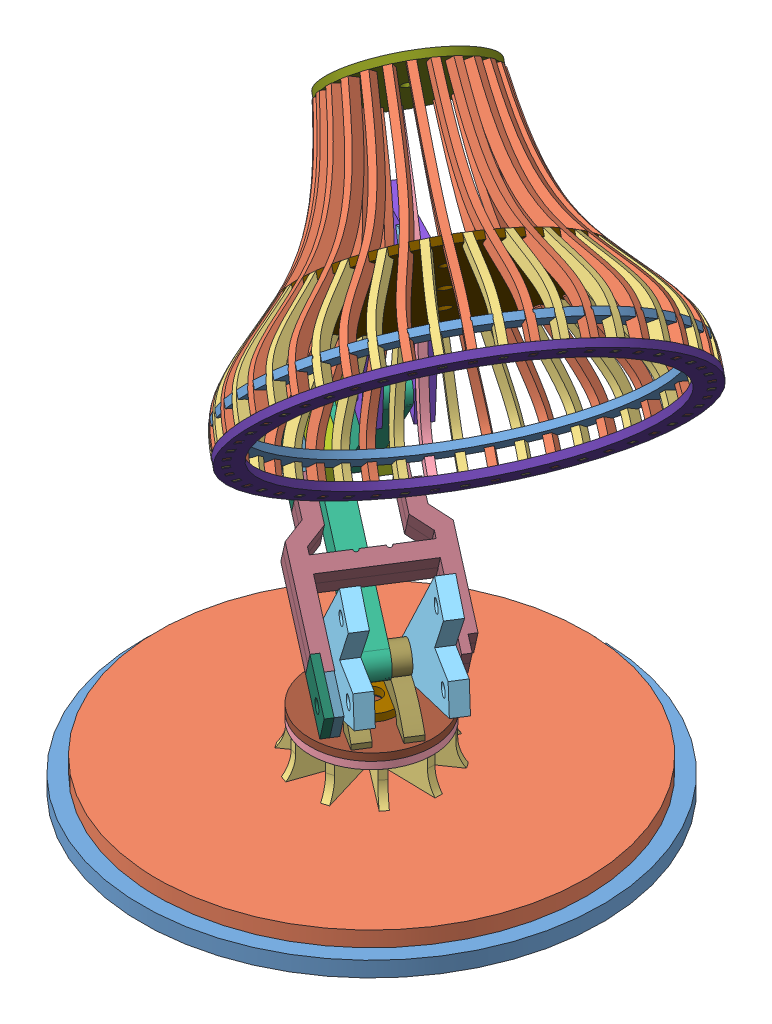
SolidWorks assembly Luxo Lamp.SLDASM, configuration Default (file format 6000). Lengths in mm.
Overall size (276.59 337.52 242.21).
89 component instances, 23 part files, 85 mates.
Components (placement in the parent):
- Base1-1: Base1.SLDPRT [Default] at (100.7787 68.4095 151.632) size (190.5 6.35 190.48)
- Base2-1: Base2.SLDPRT [Default] at (100.7787 74.7595 151.632) x (0.999762 0 0.021818) z (-0.021818 0 0.999762) size (177.8 6.35 177.8)
- Base Struts-1: Base Struts.SLDPRT [Default] at (87.312 79.649 143.1148) x (0.605296 0 -0.796) z (0.796 0 0.605296) size (3 18.54 22.23)
- Base Struts-2: Base Struts.SLDPRT [Default] at (84.8776 79.649 152.657) x (0.021818 0 -0.999762) z (0.999762 0 0.021818) size (3 18.54 22.23)
- Base Struts-3: Base Struts.SLDPRT [Default] at (88.5168 79.649 161.8077) x (-0.569995 0 -0.821648) z (0.821648 0 -0.569995) size (3 18.54 22.23)
- Base Struts-4: Base Struts.SLDPRT [Default] at (96.8397 79.649 167.0717) x (-0.944088 0 -0.329693) z (0.329693 0 -0.944088) size (3 18.54 22.23)
- Base Struts-5: Base Struts.SLDPRT [Default] at (106.6672 79.649 166.4382) x (-0.957572 0 0.288194) z (-0.288194 0 -0.957572) size (3 18.54 22.23)
- Base Struts-6: Base Struts.SLDPRT [Default] at (114.2454 79.649 160.1493) x (-0.605296 0 0.796) z (-0.796 0 -0.605296) size (3 18.54 22.23)
- Base Struts-7: Base Struts.SLDPRT [Default] at (116.6799 79.649 150.6071) x (-0.021818 0 0.999762) z (-0.999762 0 -0.021818) size (3 18.54 22.23)
- Base Struts-8: Base Struts.SLDPRT [Default] at (113.0406 79.649 141.4564) x (0.569995 0 0.821648) z (-0.821648 0 0.569995) size (3 18.54 22.23)
- Base Struts-9: Base Struts.SLDPRT [Default] at (104.7177 79.649 136.1924) x (0.944088 0 0.329693) z (-0.329693 0 0.944088) size (3 18.54 22.23)
- Base Struts-10: Base Struts.SLDPRT [Default] at (94.8902 79.649 136.8259) x (0.957572 0 -0.288194) z (0.288194 0 0.957572) size (3 18.54 22.23)
- Base Top-1: Base Top.SLDPRT [Default] at (100.7787 96.8067 151.632) x (-0.796 0 -0.605296) z (-0.605296 0 0.796) size (50.8 3 50.8)
- Bracket 1-1: Bracket 1.SLDPRT [Default] at (106.7366 115.0439 142.2517) x (-0.732725 0.49652 -0.465383) z (0.53614 0 -0.844129) size (48.36 73.37 6.35)
- Bracket 1-2: Bracket 1.SLDPRT [Default] at (91.4164 115.0439 166.3727) x (-0.732725 0.49652 -0.465383) z (0.53614 0 -0.844129) size (48.36 73.37 6.35)
- Strut-1: Strut.SLDPRT [Default] at (67.8361 133.9001 136.3508) x (-0.39166 -0.885845 -0.248759) z (0.53614 0 -0.844129) size (12.7 93.98 9.53)
- Bracket 2-1: Bracket 2.SLDPRT [Default] at (42.5535 152.7563 109.009) x (-0.489425 0.814759 -0.310853) z (0.53614 0 -0.844129) size (60.9 65.32 6.35)
- Bracket 2-2: Bracket 2.SLDPRT [Default] at (34.0423 152.7563 122.4096) x (-0.489425 0.814759 -0.310853) z (0.53614 0 -0.844129) size (60.9 65.32 6.35)
- Bracket 3-1: Bracket 3.SLDPRT [Default] at (124.9103 260.4199 161.3171) x (-0.316592 0.927004 -0.20108) z (0.53614 0 -0.844129) size (67.57 55.73 6.35)
- Bracket 3-2: Bracket 3.SLDPRT [Default] at (116.3991 260.4199 174.7176) x (-0.316592 0.927004 -0.20108) z (0.53614 0 -0.844129) size (67.57 55.73 6.35)
- Strut-2: Strut.SLDPRT [Default] at (99.7866 202.9762 156.6438) x (-0.628277 0.667857 -0.399043) z (0.53614 0 -0.844129) size (12.7 93.98 9.53)
- Strut-3: Strut.SLDPRT [Default] at (73.6972 239.206 140.0734) x (-0.670979 0.606771 -0.426165) z (0.53614 0 -0.844129) size (12.7 93.98 9.53)
- Swivel Bearing Clip-1: Swivel Bearing Clip.SLDPRT [Default] at (100.7787 90.8123 151.632) x (0.997429 0 0.071662) z (-0.071662 0 0.997429) size (20.32 3 20.32)
- Swivel Bearing Spacer-1: Swivel Bearing Spacer.SLDPRT [Default] at (100.7787 100.1595 151.632) x (0.975702 0 -0.2191) z (0 -1 0) size (15.24 15.24 6.35)
- Swivel Plate-1: Swivel Plate.SLDPRT [Default] at (100.7787 96.8067 151.632) x (0.53614 0 -0.844129) z (0.844129 0 0.53614) size (50.8 3 50.8)
- Swivel Bearing Clip-2: Swivel Bearing Clip.SLDPRT [Default] at (100.7787 100.1595 151.632) size (20.32 3 20.32)
- Swivel to Pivot-1: Swivel to Pivot.SLDPRT [Default] at (94.8209 99.8039 161.0124) x (-0.844129 0 -0.53614) z (0.53614 0 -0.844129) size (44.2 23.75 6.35)
- Swivel to Pivot-2: Swivel to Pivot.SLDPRT [Default] at (103.3321 99.8039 147.6119) x (-0.844129 0 -0.53614) z (0.53614 0 -0.844129) size (44.2 23.75 6.35)
- Special Strut-1: Special Strut.SLDPRT [Default] at (136.8693 129.3907 176.4352) x (0.53614 0 -0.844129) z (0.747768 -0.463981 0.474937) size (50.5 6.35 66.04)
- Special Strut-2: Special Strut.SLDPRT [Default] at (141.8433 140.641 179.5944) x (-0.53614 0 0.844129) z (0.747768 -0.463981 0.474937) size (50.5 6.35 66.04)
- Short Hole Plate-1: Short Hole Plate.SLDPRT [Default] at (130.6379 125.8552 198.8364) x (-0.747768 0.463981 -0.474937) z (0.53614 0 -0.844129) size (15.24 12.7 3)
- Long Hole Plate-1: Long Hole Plate.SLDPRT [Default] at (129.031 125.8552 201.3665) x (-0.747768 0.463981 -0.474937) z (0.53614 0 -0.844129) size (21.59 12.7 3)
- Long Hole Plate-2: Long Hole Plate.SLDPRT [Default] at (65.235 181.8889 153.3246) x (0.747768 -0.463981 0.474937) z (0.53614 0 -0.844129) size (21.59 12.7 3)
- Short Hole Plate-2: Short Hole Plate.SLDPRT [Default] at (73.2638 163.5676 154.8734) x (-0.747768 0.463981 -0.474937) z (0.53614 0 -0.844129) size (15.24 12.7 3)
- Lamp Shade Top Disk-1: Lamp Shade Top Disk.SLDPRT [Default] at (132.7701 345.9993 167.9269) x (0.653427 0.191305 -0.732417) z (0.389074 0.745086 0.541727) size (57.15 3 57.15)
- Lamp Shade Bottom Disk-1: Lamp Shade Bottom Disk.SLDPRT [Default] at (200.3469 279.2599 210.7639) x (0.571952 0.767735 0.288884) z (-0.501215 0.048302 0.863973) size (152.4 3 152.4)
- Lamp Shade Mid Disk-1: Lamp Shade Mid Disk.SLDPRT [Default] at (171.3931 307.9811 192.4538) x (0.599511 0.096413 -0.794539) z (0.649349 -0.638944 0.412427) size (102.19 102.16 2.95)
- Lamp Shade Bottom Disk 2-1: Lamp Shade Bottom Disk 2.SLDPRT [Default] at (193.9308 285.8302 206.7796) x (0.742668 0.649502 -0.163071) z (-0.649349 0.638944 -0.412427) size (150.54 150.51 2.95)
- Lamp Shade 1-27: Lamp Shade 1.SLDPRT [Default] at (199.7013 278.4095 209.8471) x (0.676568 0.237712 -0.696957) z (0.347278 0.731603 0.586647) size (52.7 106.68 3)
- Lamp Shade 1-28: Lamp Shade 1.SLDPRT [Default] at (199.4834 278.3594 210.1125) x (0.568948 0.048302 -0.820954) z (0.504623 0.767735 0.394891) size (52.7 106.68 3)
- Lamp Shade 1-29: Lamp Shade 1.SLDPRT [Default] at (199.3095 278.3762 210.4123) x (0.425579 -0.144144 -0.893367) z (0.630261 0.755627 0.178322) size (52.7 106.68 3)
- Lamp Shade 1-30: Lamp Shade 1.SLDPRT [Default] at (199.1904 278.4587 210.7276) x (0.255469 -0.327532 -0.909647) z (0.716297 0.696041 -0.049452) size (52.7 106.68 3)
- Lamp Shade 1-31: Lamp Shade 1.SLDPRT [Default] at (199.1336 278.6017 211.0386) x (0.069307 -0.49034 -0.868771) z (0.757326 0.59272 -0.274119) size (52.7 106.68 3)
- Lamp Shade 1-32: Lamp Shade 1.SLDPRT [Default] at (199.1427 278.7963 211.3258) x (-0.12121 -0.622339 -0.773306) z (0.750769 0.452156 -0.481561) size (52.7 106.68 3)
- Lamp Shade 1-33: Lamp Shade 1.SLDPRT [Default] at (199.2171 279.0302 211.5711) x (-0.30411 -0.715233 -0.629252) z (0.697039 0.283181 -0.658746) size (52.7 106.68 3)
- Lamp Shade 1-34: Lamp Shade 1.SLDPRT [Default] at (199.3521 279.2888 211.759) x (-0.467903 -0.763187 -0.44566) z (0.599511 0.096413 -0.794539) size (52.7 106.68 3)
- Lamp Shade 1-35: Lamp Shade 1.SLDPRT [Default] at (199.5392 279.5557 211.8779) x (-0.602295 -0.763187 -0.234065) z (0.464313 -0.096413 -0.880408) size (52.7 106.68 3)
- Lamp Shade 1-36: Lamp Shade 1.SLDPRT [Default] at (199.7668 279.8142 211.9202) x (-0.698843 -0.715233 -0.007763) z (0.299941 -0.283181 -0.910958) size (52.7 106.68 3)
- Lamp Shade 1-37: Lamp Shade 1.SLDPRT [Default] at (200.0204 280.0481 211.8833) x (-0.75148 -0.622339 0.219027) z (0.116723 -0.452156 -0.884269) size (52.7 106.68 3)
- Lamp Shade 1-38: Lamp Shade 1.SLDPRT [Default] at (200.2842 280.2427 211.7694) x (-0.756898 -0.49034 0.432055) z (-0.073829 -0.59272 -0.802018) size (52.7 106.68 3)
- Lamp Shade 1-39: Lamp Shade 1.SLDPRT [Default] at (200.5416 280.3857 211.5858) x (-0.714758 -0.327532 0.617935) z (-0.259743 -0.696041 -0.669373) size (52.7 106.68 3)
- Lamp Shade 1-40: Lamp Shade 1.SLDPRT [Default] at (200.7763 280.4682 211.3439) x (-0.627707 -0.144144 0.764988) z (-0.429336 -0.755627 -0.49467) size (52.7 106.68 3)
- Lamp Shade 1-41: Lamp Shade 1.SLDPRT [Default] at (200.9737 280.485 211.0591) x (-0.501215 0.048302 0.863973) z (-0.571952 -0.767735 -0.288884) size (52.7 106.68 3)
- Lamp Shade 1-42: Lamp Shade 1.SLDPRT [Default] at (201.1214 280.435 210.7491) x (-0.34323 0.237712 0.908673) z (-0.67863 -0.731603 -0.064947) size (52.7 106.68 3)
- Lamp Shade 1-43: Lamp Shade 1.SLDPRT [Default] at (201.2101 280.3213 210.4334) x (-0.163679 0.412186 0.896277) z (-0.742668 -0.649502 0.163071) size (52.7 106.68 3)
- Lamp Shade 1-44: Lamp Shade 1.SLDPRT [Default] at (201.2341 280.1512 210.132) x (0.026158 0.560761 0.827564) z (-0.760041 -0.52659 0.380843) size (52.7 106.68 3)
- Lamp Shade 1-45: Lamp Shade 1.SLDPRT [Default] at (201.1921 279.9352 209.8636) x (0.21435 0.674102 0.706853) z (-0.729657 -0.37059 0.574685) size (52.7 106.68 3)
- Lamp Shade 1-46: Lamp Shade 1.SLDPRT [Default] at (201.0865 279.687 209.6453) x (0.389074 0.745086 0.541727) z (-0.653427 -0.191305 0.732417) size (52.7 106.68 3)
- Lamp Shade 1-47: Lamp Shade 1.SLDPRT [Default] at (200.7152 279.1574 209.4094) x (0.655739 0.745086 0.121875) z (-0.385164 0.191305 0.902802) size (52.7 106.68 3)
- Lamp Shade 1-48: Lamp Shade 1.SLDPRT [Default] at (200.4727 278.9092 209.4067) x (0.730925 0.674102 -0.106472) z (-0.209988 0.37059 0.904747) size (52.7 106.68 3)
- Lamp Shade 1-49: Lamp Shade 1.SLDPRT [Default] at (200.2119 278.6933 209.4827) x (0.760183 0.560761 -0.328128) z (-0.021617 0.52659 0.849845) size (52.7 106.68 3)
- Lamp Shade 1-50: Lamp Shade 1.SLDPRT [Default] at (199.9493 278.5231 209.6327) x (0.741677 0.412186 -0.529167) z (0.168112 0.649502 0.741543) size (52.7 106.68 3)
- Lamp Shade 2-27: Lamp Shade 2.SLDPRT [Default] at (201.3062 279.879 209.5967) x (0.30411 0.715233 0.629252) z (-0.697039 -0.283181 0.658746) size (29.44 44.45 3)
- Lamp Shade 2-28: Lamp Shade 2.SLDPRT [Default] at (201.1489 279.5777 209.3777) x (0.467903 0.763187 0.44566) z (-0.599511 -0.096413 0.794539) size (29.44 44.45 3)
- Lamp Shade 2-29: Lamp Shade 2.SLDPRT [Default] at (200.9309 279.2667 209.2392) x (0.602295 0.763187 0.234065) z (-0.464313 0.096413 0.880408) size (29.44 44.45 3)
- Lamp Shade 2-30: Lamp Shade 2.SLDPRT [Default] at (200.6658 278.9655 209.1899) x (0.698843 0.715233 0.007763) z (-0.299941 0.283181 0.910958) size (29.44 44.45 3)
- Lamp Shade 2-31: Lamp Shade 2.SLDPRT [Default] at (200.3703 278.6929 209.2329) x (0.75148 0.622339 -0.219027) z (-0.116723 0.452156 0.884269) size (29.44 44.45 3)
- Lamp Shade 2-32: Lamp Shade 2.SLDPRT [Default] at (200.0629 278.4662 209.3656) x (0.756898 0.49034 -0.432055) z (0.073829 0.59272 0.802018) size (29.44 44.45 3)
- Lamp Shade 2-33: Lamp Shade 2.SLDPRT [Default] at (199.7631 278.2996 209.5795) x (0.714758 0.327532 -0.617935) z (0.259743 0.696041 0.669373) size (29.44 44.45 3)
- Lamp Shade 2-34: Lamp Shade 2.SLDPRT [Default] at (199.4895 278.2035 209.8613) x (0.627707 0.144144 -0.764988) z (0.429336 0.755627 0.49467) size (29.44 44.45 3)
- Lamp Shade 2-35: Lamp Shade 2.SLDPRT [Default] at (199.2595 278.1839 210.1932) x (0.501215 -0.048302 -0.863973) z (0.571952 0.767735 0.288884) size (29.44 44.45 3)
- Lamp Shade 2-36: Lamp Shade 2.SLDPRT [Default] at (199.0874 278.2422 210.5544) x (0.34323 -0.237712 -0.908673) z (0.67863 0.731603 0.064947) size (29.44 44.45 3)
- Lamp Shade 2-37: Lamp Shade 2.SLDPRT [Default] at (198.9841 278.3746 210.9222) x (0.163679 -0.412186 -0.896277) z (0.742668 0.649502 -0.163071) size (29.44 44.45 3)
- Lamp Shade 2-38: Lamp Shade 2.SLDPRT [Default] at (198.9561 278.5729 211.2734) x (-0.026158 -0.560761 -0.827564) z (0.760041 0.52659 -0.380843) size (29.44 44.45 3)
- Lamp Shade 2-39: Lamp Shade 2.SLDPRT [Default] at (199.0051 278.8245 211.5861) x (-0.21435 -0.674102 -0.706853) z (0.729657 0.37059 -0.574685) size (29.44 44.45 3)
- Lamp Shade 2-40: Lamp Shade 2.SLDPRT [Default] at (199.1281 279.1137 211.8405) x (-0.389074 -0.745086 -0.541727) z (0.653427 0.191305 -0.732417) size (29.44 44.45 3)
- Lamp Shade 2-41: Lamp Shade 2.SLDPRT [Default] at (199.3173 279.4222 212.0207) x (-0.539352 -0.769253 -0.342563) z (0.53614 0 -0.844129) size (29.44 44.45 3)
- Lamp Shade 2-42: Lamp Shade 2.SLDPRT [Default] at (199.5608 279.7308 212.1153) x (-0.655739 -0.745086 -0.121875) z (0.385164 -0.191305 -0.902802) size (29.44 44.45 3)
- Lamp Shade 2-43: Lamp Shade 2.SLDPRT [Default] at (199.8433 280.0199 212.1184) x (-0.730925 -0.674102 0.106472) z (0.209988 -0.37059 -0.904747) size (29.44 44.45 3)
- Lamp Shade 2-44: Lamp Shade 2.SLDPRT [Default] at (200.1471 280.2716 212.0299) x (-0.760183 -0.560761 0.328128) z (0.021617 -0.52659 -0.849845) size (29.44 44.45 3)
- Lamp Shade 2-45: Lamp Shade 2.SLDPRT [Default] at (200.4531 280.4698 211.8552) x (-0.741677 -0.412186 0.529167) z (-0.168112 -0.649502 -0.741543) size (29.44 44.45 3)
- Lamp Shade 2-46: Lamp Shade 2.SLDPRT [Default] at (200.7421 280.6022 211.6054) x (-0.676568 -0.237712 0.696957) z (-0.347278 -0.731603 -0.586647) size (29.44 44.45 3)
- Lamp Shade 2-47: Lamp Shade 2.SLDPRT [Default] at (200.9959 280.6605 211.2961) x (-0.568948 -0.048302 0.820954) z (-0.504623 -0.767735 -0.394891) size (29.44 44.45 3)
- Lamp Shade 2-48: Lamp Shade 2.SLDPRT [Default] at (201.1985 280.641 210.9468) x (-0.425579 0.144144 0.893367) z (-0.630261 -0.755627 -0.178322) size (29.44 44.45 3)
- Lamp Shade 2-49: Lamp Shade 2.SLDPRT [Default] at (201.3373 280.5449 210.5794) x (-0.255469 0.327532 0.909647) z (-0.716297 -0.696041 0.049452) size (29.44 44.45 3)
- Lamp Shade 2-50: Lamp Shade 2.SLDPRT [Default] at (201.4035 280.3782 210.217) x (-0.069307 0.49034 0.868771) z (-0.757326 -0.59272 0.274119) size (29.44 44.45 3)
- Lamp Shade 2-51: Lamp Shade 2.SLDPRT [Default] at (201.3929 280.1515 209.8825) x (0.12121 0.622339 0.773306) z (-0.750769 -0.452156 0.481561) size (29.44 44.45 3)
- Lamp Shade 3-1: Lamp Shade 3.SLDPRT [Default] at (201.0009 279.5999 209.6452) x (0.539352 0.769253 0.342563) z (-0.53614 0 0.844129) size (52.7 106.68 3)
- Lamp Shade 4-1: Lamp Shade 4.SLDPRT [Default] at (199.3939 279.5999 212.1752) x (0.539352 0.769253 0.342563) z (-0.53614 0 0.844129) size (28.64 27.05 3)
Mates (geometry in assembly coordinates):
- Concentric1: concentric aligned: circle of Base1-1; circle of Base2-1
- Coincident2: coincident anti-aligned: plane of Base1-1 through (100.7787 74.7595 151.632) normal (0 1 0); plane of Base2-1 through (100.7787 74.7595 151.632) normal (0 -1 0)
- Coincident6: coincident anti-aligned: plane of Base2-1 through (85.9397 74.7595 138.625) normal (0.796 0 0.605296); plane of Base Struts-1 through (86.0934 79.649 138.4228) normal (-0.796 0 -0.605296)
- Coincident7: coincident anti-aligned: plane of Base2-1 through (90.3447 74.7595 145.4209) normal (0.605296 0 -0.796); plane of Base Struts-1 through (87.312 79.649 143.1148) normal (-0.605296 0 0.796)
- Coincident8: coincident anti-aligned: plane of Base2-1 through (100.7787 81.1095 151.632) normal (0 1 0); plane of Base Struts-1 through (89.1262 81.1095 140.729) normal (0 -1 0)
- Coincident9: coincident anti-aligned: plane of Base Struts-6 through (112.4313 93.8095 162.5351) normal (0 1 0); plane of Base Top-1 through (100.7787 93.8095 151.632) normal (0 -1 0)
- Concentric2: concentric anti-aligned: circle of Base2-1; circle of Base Top-1
- Coincident10: coincident anti-aligned: plane of Base Struts-6 through (114.2454 79.649 160.1493) normal (0.605296 0 -0.796); plane of Base Top-1 through (111.2127 93.8095 157.8432) normal (-0.605296 0 0.796)
- Concentric3: concentric anti-aligned: cylinder of Bracket 1-2 through (94.8209 115.0439 161.0124) axis (-0.53614 0 0.844129) radius 2.54; circle of Strut-1
- Concentric4: concentric aligned: circle of Bracket 1-1; circle of Strut-1
- Coincident16: coincident aligned: plane of Bracket 1-1 through (101.6346 114.2203 131.4886) normal (-0.646098 0.643553 -0.410362); plane of Bracket 1-2 through (86.3144 114.2203 155.6096) normal (-0.646098 0.643553 -0.410362)
- Concentric5: concentric aligned: circle of Strut-1; circle of Bracket 2-1
- Coincident18: coincident anti-aligned: plane of Strut-1 through (42.5535 152.7563 109.009) normal (0.53614 0 -0.844129); plane of Bracket 2-1 through (42.5535 152.7563 109.009) normal (-0.53614 0 0.844129)
- Concentric6: concentric aligned: circle of Strut-1; circle of Bracket 2-2
- Coincident20: coincident anti-aligned: plane of Strut-1 through (37.4468 152.7563 117.0494) normal (-0.53614 0 0.844129); plane of Bracket 2-2 through (37.4468 152.7563 117.0494) normal (0.53614 0 -0.844129)
- Coincident21: coincident aligned: plane of Bracket 2-1 through (65.0117 182.4 115.7506) normal (0.105893 0.9921 0.067257); plane of Bracket 2-2 through (56.5005 182.4 129.1511) normal (0.105893 0.9921 0.067257)
- Concentric7: concentric aligned: circle of Bracket 2-1; circle of Strut-3
- Coincident23: coincident anti-aligned: plane of Bracket 2-1 through (42.5535 152.7563 109.009) normal (-0.53614 0 0.844129); plane of Strut-3 through (99.6195 271.5098 145.2539) normal (0.53614 0 -0.844129)
- Concentric8: concentric aligned: circle of Bracket 2-1; circle of Strut-2
- Coincident25: coincident anti-aligned: plane of Bracket 2-1 through (42.5535 152.7563 109.009) normal (-0.53614 0 0.844129); plane of Strut-2 through (127.8044 233.2241 163.1552) normal (0.53614 0 -0.844129)
- Concentric9: concentric aligned: circle of Bracket 3-2; circle of Strut-2
- Coincident27: coincident anti-aligned: plane of Bracket 3-2 through (119.8036 260.4199 169.3574) normal (0.53614 0 -0.844129); plane of Strut-2 through (122.6977 233.2241 171.1956) normal (-0.53614 0 0.844129)
- Concentric10: concentric aligned: circle of Bracket 3-2; circle of Strut-3
- Concentric11: concentric aligned: circle of Bracket 3-1; circle of Strut-3
- Coincident30: coincident anti-aligned: plane of Bracket 3-1 through (124.9103 260.4199 161.3171) normal (-0.53614 0 0.844129); plane of Strut-3 through (99.6195 271.5098 145.2539) normal (0.53614 0 -0.844129)
- Concentric12: concentric aligned: circle of Bracket 3-1; circle of Strut-2
- Concentric13: concentric anti-aligned: circle of Base Top-1; circle of Swivel Bearing Clip-1
- Coincident32: coincident anti-aligned: plane of Base Top-1 through (100.7787 93.8095 151.632) normal (0 -1 0); plane of Swivel Bearing Clip-1 through (100.7787 93.8095 151.632) normal (0 1 0)
- Coincident34: coincident anti-aligned: plane of Swivel Bearing Clip-1 through (100.7787 93.8095 151.632) normal (0 1 0); plane of Swivel Bearing Spacer-1 through (100.7787 93.8095 151.632) normal (0 -1 0)
- Concentric15: concentric aligned: circle of Base Top-1; circle of Swivel Bearing Spacer-1
- Concentric16: concentric anti-aligned: circle of Base Top-1; circle of Swivel Plate-1
- Coincident37: coincident anti-aligned: plane of Base Top-1 through (100.7787 96.8067 151.632) normal (0 1 0); plane of Swivel Plate-1 through (100.7787 96.8067 151.632) normal (0 -1 0)
- Concentric17: concentric anti-aligned: circle of Swivel Bearing Spacer-1; circle of Swivel Bearing Clip-2
- Coincident39: coincident anti-aligned: plane of Swivel Bearing Spacer-1 through (100.7787 100.1595 151.632) normal (0 1 0); plane of Swivel Bearing Clip-2 through (100.7787 100.1595 151.632) normal (0 -1 0)
- Coincident40: coincident anti-aligned: plane of Swivel Plate-1 through (100.7787 99.8039 151.632) normal (0 1 0); plane of Swivel to Pivot-1 through (98.2253 99.8039 155.6522) normal (0 -1 0)
- Coincident44: coincident anti-aligned: plane of Swivel Plate-1 through (108.9458 99.8039 162.4612) normal (-0.53614 0 0.844129); plane of Swivel to Pivot-1 through (98.2253 99.8039 155.6522) normal (0.53614 0 -0.844129)
- Coincident45: coincident anti-aligned: plane of Swivel Plate-1 through (108.9458 99.8039 162.4612) normal (0.844129 0 0.53614); plane of Swivel to Pivot-1 through (108.9458 99.8039 162.4612) normal (-0.844129 0 -0.53614)
- Coincident46: coincident anti-aligned: plane of Swivel Plate-1 through (87.2514 99.8039 137.3984) normal (0.844129 0 0.53614); plane of Swivel to Pivot-2 through (90.6559 99.8039 132.0382) normal (-0.844129 0 -0.53614)
- Coincident47: coincident anti-aligned: plane of Swivel Plate-1 through (92.6116 99.8039 140.8029) normal (0.53614 0 -0.844129); plane of Swivel to Pivot-2 through (103.3321 99.8039 147.6119) normal (-0.53614 0 0.844129)
- Coincident48: coincident anti-aligned: plane of Swivel Plate-1 through (100.7787 99.8039 151.632) normal (0 1 0); plane of Swivel to Pivot-2 through (106.7366 99.8039 142.2517) normal (0 -1 0)
- Concentric19: concentric aligned: circle of Strut-1; circle of Swivel to Pivot-2
- Coincident50: coincident anti-aligned: plane of Strut-1 through (42.5535 152.7563 109.009) normal (0.53614 0 -0.844129); plane of Swivel to Pivot-2 through (103.3321 99.8039 147.6119) normal (-0.53614 0 0.844129)
- Coincident51: coincident anti-aligned: plane of Bracket 1-1 through (106.7366 115.0439 142.2517) normal (-0.53614 0 0.844129); plane of Swivel to Pivot-2 through (106.7366 99.8039 142.2517) normal (0.53614 0 -0.844129)
- Coincident52: coincident anti-aligned: plane of Bracket 1-2 through (94.8209 115.0439 161.0124) normal (0.53614 0 -0.844129); plane of Swivel to Pivot-1 through (94.8209 99.8039 161.0124) normal (-0.53614 0 0.844129)
- Coincident54: coincident anti-aligned: plane of Bracket 1-1 through (110.1411 115.0439 136.8914) normal (0.53614 0 -0.844129); plane of Special Strut-1 through (149.5698 135.0159 161.9342) normal (-0.53614 0 0.844129)
- Coincident55: coincident anti-aligned: plane of Special Strut-1 through (139.3563 135.0159 178.0148) normal (0.39166 0.885845 0.248759); plane of Special Strut-2 through (139.3563 135.0159 178.0148) normal (-0.39166 -0.885845 -0.248759)
- Coincident56: coincident aligned: plane of Special Strut-1 through (125.8201 135.0159 199.3271) normal (-0.53614 0 0.844129); plane of Special Strut-2 through (125.8201 135.0159 199.3271) normal (-0.53614 0 0.844129)
- Coincident57: coincident aligned: plane of Special Strut-1 through (133.6583 138.5514 174.3958) normal (0.747768 -0.463981 0.474937); plane of Special Strut-2 through (133.6583 138.5514 174.3958) normal (0.747768 -0.463981 0.474937)
- Coincident58: coincident anti-aligned: plane of Special Strut-2 through (133.6583 138.5514 174.3958) normal (0.747768 -0.463981 0.474937); plane of Short Hole Plate-1 through (120.8489 132.9263 189.0684) normal (-0.747768 0.463981 -0.474937)
- Coincident59: coincident aligned: plane of Special Strut-2 through (127.427 135.0159 196.797) normal (-0.53614 0 0.844129); plane of Short Hole Plate-1 through (130.6379 125.8552 198.8364) normal (-0.53614 0 0.844129)
- Coincident60: coincident aligned: plane of Special Strut-2 through (141.8433 140.641 179.5944) normal (0.39166 0.885845 0.248759); plane of Short Hole Plate-1 through (137.2189 137.1054 199.4656) normal (0.39166 0.885845 0.248759)
- Coincident61: coincident aligned: plane of Short Hole Plate-1 through (137.2189 137.1054 199.4656) normal (0.39166 0.885845 0.248759); plane of Long Hole Plate-1 through (135.612 137.1054 201.9957) normal (0.39166 0.885845 0.248759)
- Coincident62: coincident aligned: plane of Short Hole Plate-1 through (132.2448 125.8552 196.3064) normal (0.747768 -0.463981 0.474937); plane of Long Hole Plate-1 through (130.6379 125.8552 198.8364) normal (0.747768 -0.463981 0.474937)
- Coincident63: coincident anti-aligned: plane of Short Hole Plate-1 through (130.6379 125.8552 198.8364) normal (-0.53614 0 0.844129); plane of Long Hole Plate-1 through (130.6379 125.8552 198.8364) normal (0.53614 0 -0.844129)
- Coincident67: coincident aligned: plane of Special Strut-1 through (130.8315 135.0159 191.4368) normal (-0.53614 0 0.844129); plane of Short Hole Plate-2 through (73.2638 163.5676 154.8734) normal (-0.53614 0 0.844129)
- Coincident68: coincident aligned: plane of Special Strut-2 through (141.8433 140.641 179.5944) normal (0.39166 0.885845 0.248759); plane of Short Hole Plate-2 through (79.8449 174.8178 155.5026) normal (0.39166 0.885845 0.248759)
- Coincident69: coincident anti-aligned: plane of Special Strut-2 through (84.2757 169.1927 143.031) normal (-0.747768 0.463981 -0.474937); plane of Short Hole Plate-2 through (74.8708 163.5676 152.3433) normal (0.747768 -0.463981 0.474937)
- Coincident70: coincident aligned: plane of Special Strut-2 through (129.2245 135.0159 193.9668) normal (-0.53614 0 0.844129); plane of Long Hole Plate-2 through (65.235 181.8889 153.3246) normal (-0.53614 0 0.844129)
- Coincident71: coincident aligned: plane of Long Hole Plate-2 through (66.842 181.8889 150.7946) normal (0.39166 0.885845 0.248759); plane of Short Hole Plate-2 through (79.8449 174.8178 155.5026) normal (0.39166 0.885845 0.248759)
- Coincident72: coincident aligned: plane of Long Hole Plate-2 through (66.842 181.8889 150.7946) normal (-0.747768 0.463981 -0.474937); plane of Short Hole Plate-2 through (63.4748 170.6387 145.1053) normal (-0.747768 0.463981 -0.474937)
- Concentric21: concentric aligned: circle of Bracket 2-2; circle of Long Hole Plate-2
- Concentric22: concentric aligned: circle of Bracket 1-2; circle of Long Hole Plate-1
- Coincident87: coincident anti-aligned: plane of Lamp Shade Top Disk-1 through (132.7701 345.9993 167.9269) normal (0.649349 -0.638944 0.412427); plane of Lamp Shade 1-27 through (114.5956 338.6304 185.126) normal (-0.649349 0.638944 -0.412427)
- Coincident88: coincident anti-aligned: plane of Lamp Shade Top Disk-1 through (113.6902 342.7382 185.6482) normal (0.676568 0.237712 -0.696957); plane of Lamp Shade 1-27 through (112.8143 340.3832 183.9946) normal (-0.676568 -0.237712 0.696957)
- Coincident89: coincident anti-aligned: plane of Lamp Shade Top Disk-1 through (115.4946 343.3722 183.7894) normal (-0.347278 -0.731603 -0.586647); plane of Lamp Shade 1-27 through (136.734 301.6376 223.2632) normal (0.347278 0.731603 0.586647)
- Coincident90: coincident anti-aligned: plane of Lamp Shade Mid Disk-1 through (141.3134 294.8578 226.6261) normal (-0.676568 -0.237712 0.696957); plane of Lamp Shade 1-27 through (138.8444 295.5697 224.4721) normal (0.676568 0.237712 -0.696957)
- Coincident91: coincident anti-aligned: plane of Lamp Shade Mid Disk-1 through (173.7915 307.1206 194.4885) normal (-0.347278 -0.731603 -0.586647); plane of Lamp Shade 1-27 through (136.734 301.6376 223.2632) normal (0.347278 0.731603 0.586647)
- Coincident92: coincident anti-aligned: plane of Lamp Shade Mid Disk-1 through (171.3931 307.9811 192.4538) normal (-0.649349 0.638944 -0.412427); plane of Lamp Shade 1-27 through (140.7579 296.242 222.501) normal (0.649349 -0.638944 0.412427)
- Coincident93: coincident anti-aligned: plane of Lamp Shade Bottom Disk 2-1 through (142.8123 270.4245 256.2526) normal (-0.676568 -0.237712 0.696957); plane of Lamp Shade 1-27 through (142.2478 269.2352 255.2989) normal (0.676568 0.237712 -0.696957)
- Coincident94: coincident anti-aligned: plane of Lamp Shade Bottom Disk 2-1 through (192.4939 288.7163 206.369) normal (-0.347278 -0.731603 -0.586647); plane of Lamp Shade 1-27 through (136.734 301.6376 223.2632) normal (0.347278 0.731603 0.586647)
- Coincident95: coincident anti-aligned: plane of Lamp Shade Bottom Disk 2-1 through (192.0176 287.7128 205.5644) normal (-0.649349 0.638944 -0.412427); plane of Lamp Shade 1-27 through (144.0755 269.8774 253.4161) normal (0.649349 -0.638944 0.412427)
- Coincident96: coincident anti-aligned: plane of Lamp Shade Bottom Disk-1 through (148.084 262.6523 260.0535) normal (0.347278 0.731603 0.586647); plane of Lamp Shade 1-27 through (135.6932 299.4448 221.5049) normal (-0.347278 -0.731603 -0.586647)
- Coincident97: coincident anti-aligned: plane of Lamp Shade Bottom Disk-1 through (149.0454 264.6778 261.6777) normal (0.676568 0.237712 -0.696957); plane of Lamp Shade 1-27 through (149.8653 260.8996 261.1849) normal (-0.676568 -0.237712 0.696957)
- Coincident98: coincident anti-aligned: plane of Lamp Shade Bottom Disk-1 through (198.4007 281.175 209.5278) normal (-0.649349 0.638944 -0.412427); plane of Lamp Shade 1-27 through (148.084 262.6523 260.0535) normal (0.649349 -0.638944 0.412427)
- Coincident99: coincident anti-aligned: plane of Lamp Shade Bottom Disk-1 through (176.9648 228.8829 162.2652) normal (0.30411 0.715233 0.629252); plane of Lamp Shade 2-27 through (178.9055 227.1949 163.246) normal (-0.30411 -0.715233 -0.629252)
- Coincident100: coincident anti-aligned: plane of Lamp Shade Bottom Disk-1 through (198.4007 281.175 209.5278) normal (-0.649349 0.638944 -0.412427); plane of Lamp Shade 2-27 through (177.1242 228.9476 162.1146) normal (0.649349 -0.638944 0.412427)
- Coincident101: coincident anti-aligned: plane of Lamp Shade Bottom Disk-1 through (175.035 228.0989 164.089) normal (0.697039 0.283181 -0.658746); plane of Lamp Shade 2-27 through (152.5024 277.8941 161.6524) normal (-0.697039 -0.283181 0.658746)
- Coincident102: coincident anti-aligned: plane of Lamp Shade Bottom Disk 2-1 through (152.7917 231.7667 180.6505) normal (-0.539352 -0.769253 -0.342563); plane of Lamp Shade 3-1 through (153.5271 231.7667 179.4927) normal (0.539352 0.769253 0.342563)
- Coincident103: coincident anti-aligned: plane of Lamp Shade Bottom Disk 2-1 through (192.753 287.7128 204.4066) normal (-0.53614 0 0.844129); plane of Lamp Shade 3-1 through (143.3638 275.9556 173.0376) normal (0.53614 0 -0.844129)
- Coincident104: coincident anti-aligned: plane of Lamp Shade Bottom Disk 2-1 through (192.0176 287.7128 205.5644) normal (-0.649349 0.638944 -0.412427); plane of Lamp Shade 3-1 through (154.9842 233.8449 180.4181) normal (0.649349 -0.638944 0.412427)
- Coincident105: coincident anti-aligned: plane of Lamp Shade 3-1 through (141.7569 275.9556 175.5676) normal (-0.53614 0 0.844129); plane of Lamp Shade 4-1 through (141.7569 275.9556 175.5676) normal (0.53614 0 -0.844129)
- Concentric23: concentric aligned: circle of Lamp Shade 3-1; circle of Lamp Shade 4-1
- Coincident107: coincident anti-aligned: plane of Bracket 3-1 through (124.9103 260.4199 161.3171) normal (-0.53614 0 0.844129); plane of Lamp Shade 3-1 through (143.3638 275.9556 173.0376) normal (0.53614 0 -0.844129)
- Concentric24: concentric anti-aligned: circle of Bracket 3-1; circle of Lamp Shade 3-1
- Coincident109: coincident aligned: plane of Lamp Shade 3-1 through (143.8111 285.1345 173.3217) normal (-0.132777 0.987552 -0.084332); plane of Lamp Shade 4-1 through (142.2042 285.1345 175.8517) normal (-0.132777 0.987552 -0.084332)
